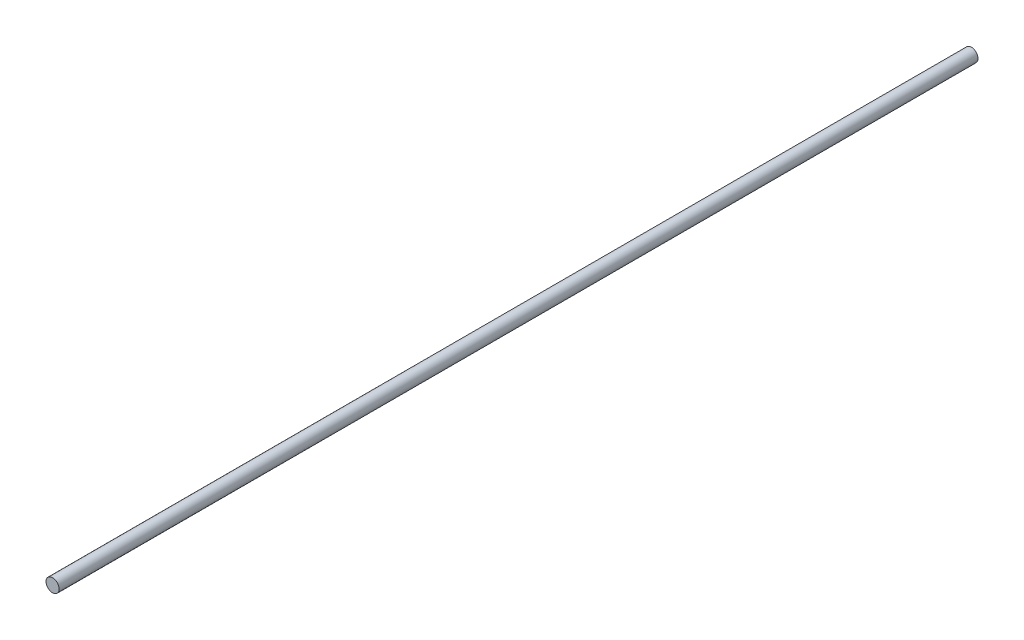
ISO-10303-21;
HEADER;
FILE_DESCRIPTION(('STEP AP214'),'2;1');
FILE_NAME('part.step','',(''),(''),'','','');
FILE_SCHEMA(('AUTOMOTIVE_DESIGN { 1 0 10303 214 1 1 1 1 }'));
ENDSEC;
DATA;
#1=APPLICATION_CONTEXT('core data for automotive mechanical design processes');
#2=APPLICATION_PROTOCOL_DEFINITION('international standard','automotive_design',2000,#1);
#3=PRODUCT_CONTEXT('',#1,'mechanical');
#4=PRODUCT('Part','Part','',(#3));
#5=PRODUCT_RELATED_PRODUCT_CATEGORY('part','',(#4));
#6=PRODUCT_DEFINITION_FORMATION('','',#4);
#7=PRODUCT_DEFINITION_CONTEXT('part definition',#1,'design');
#8=PRODUCT_DEFINITION('design','',#6,#7);
#9=PRODUCT_DEFINITION_SHAPE('','',#8);
#10=(LENGTH_UNIT() NAMED_UNIT(*) SI_UNIT(.MILLI.,.METRE.));
#11=(NAMED_UNIT(*) PLANE_ANGLE_UNIT() SI_UNIT($,.RADIAN.));
#12=(NAMED_UNIT(*) SI_UNIT($,.STERADIAN.) SOLID_ANGLE_UNIT());
#13=UNCERTAINTY_MEASURE_WITH_UNIT(LENGTH_MEASURE(1.E-05),#10,'distance_accuracy_value','');
#14=(GEOMETRIC_REPRESENTATION_CONTEXT(3) GLOBAL_UNCERTAINTY_ASSIGNED_CONTEXT((#13)) GLOBAL_UNIT_ASSIGNED_CONTEXT((#10,
#11,#12)) REPRESENTATION_CONTEXT('',''));
#15=CARTESIAN_POINT('',(0.,0.,0.));
#16=DIRECTION('',(0.,0.,1.));
#17=DIRECTION('',(1.,0.,0.));
#18=AXIS2_PLACEMENT_3D('',#15,#16,#17);
#19=CARTESIAN_POINT('',(0.,0.,-4200.));
#20=DIRECTION('',(0.,0.,1.));
#21=DIRECTION('',(1.,0.,0.));
#22=AXIS2_PLACEMENT_3D('',#19,#20,#21);
#23=CYLINDRICAL_SURFACE('',#22,30.);
#24=CARTESIAN_POINT('',(0.,0.,-4200.));
#25=DIRECTION('',(0.,0.,1.));
#26=DIRECTION('',(1.,0.,0.));
#27=AXIS2_PLACEMENT_3D('',#24,#25,#26);
#28=CIRCLE('',#27,30.);
#29=CARTESIAN_POINT('',(30.,0.,-4200.));
#30=VERTEX_POINT('',#29);
#31=EDGE_CURVE('E10',#30,#30,#28,.T.);
#32=ORIENTED_EDGE('',*,*,#31,.T.);
#33=EDGE_LOOP('',(#32));
#34=FACE_BOUND('',#33,.T.);
#35=CARTESIAN_POINT('',(0.,0.,0.));
#36=DIRECTION('',(0.,0.,1.));
#37=DIRECTION('',(1.,0.,0.));
#38=AXIS2_PLACEMENT_3D('',#35,#36,#37);
#39=CIRCLE('',#38,30.);
#40=CARTESIAN_POINT('',(30.,0.,0.));
#41=VERTEX_POINT('',#40);
#42=EDGE_CURVE('E40',#41,#41,#39,.T.);
#43=ORIENTED_EDGE('',*,*,#42,.F.);
#44=EDGE_LOOP('',(#43));
#45=FACE_BOUND('',#44,.T.);
#46=ADVANCED_FACE('F37',(#34,#45),#23,.T.);
#47=CARTESIAN_POINT('',(0.,0.,-4200.));
#48=DIRECTION('',(0.,0.,1.));
#49=DIRECTION('',(1.,0.,0.));
#50=AXIS2_PLACEMENT_3D('',#47,#48,#49);
#51=PLANE('',#50);
#52=ORIENTED_EDGE('',*,*,#31,.F.);
#53=EDGE_LOOP('',(#52));
#54=FACE_BOUND('',#53,.T.);
#55=ADVANCED_FACE('F54',(#54),#51,.F.);
#56=CARTESIAN_POINT('',(0.,0.,0.));
#57=DIRECTION('',(0.,0.,1.));
#58=DIRECTION('',(1.,0.,0.));
#59=AXIS2_PLACEMENT_3D('',#56,#57,#58);
#60=PLANE('',#59);
#61=ORIENTED_EDGE('',*,*,#42,.T.);
#62=EDGE_LOOP('',(#61));
#63=FACE_BOUND('',#62,.T.);
#64=ADVANCED_FACE('F51',(#63),#60,.T.);
#65=CLOSED_SHELL('',(#46,#55,#64));
#66=MANIFOLD_SOLID_BREP('B2',#65);
#67=ADVANCED_BREP_SHAPE_REPRESENTATION('',(#18,#66),#14);
#68=SHAPE_DEFINITION_REPRESENTATION(#9,#67);
ENDSEC;
END-ISO-10303-21;
